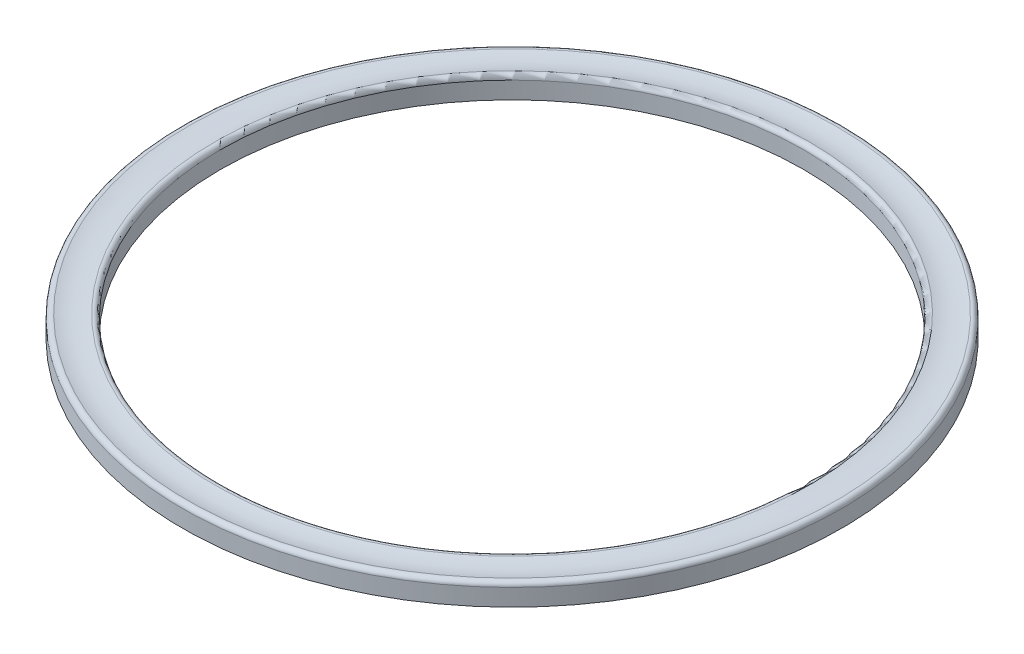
from build123d import *


with BuildPart() as part:
    # Sketch1 → Base-Revolve (revolve)
    with BuildSketch(Plane.XY, mode=Mode.PRIVATE) as base_revolve_sk:
        with BuildLine():
            Line((19.0881, 0), (19.0881, 0.989941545))
            ThreePointArc((19.0881, 0.989941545), (18.990942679, 1.189732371), (18.773797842, 1.236679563))
            ThreePointArc((18.773797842, 1.236679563), (17.9959, 1.143), (17.218002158, 1.236679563))
            ThreePointArc((17.218002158, 1.236679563), (17.000857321, 1.189732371), (16.9037, 0.989941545))
            Line((16.9037, 0.989941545), (16.9037, 0))
            Line((16.9037, 0), (19.0881, 0))
        make_face()
    revolve(base_revolve_sk.sketch.rotate(Axis((0, 0, 0), (0, 1, 0)), 90), axis=Axis((0, 0, 0), (0, 1, 0)))


solid = part.part
